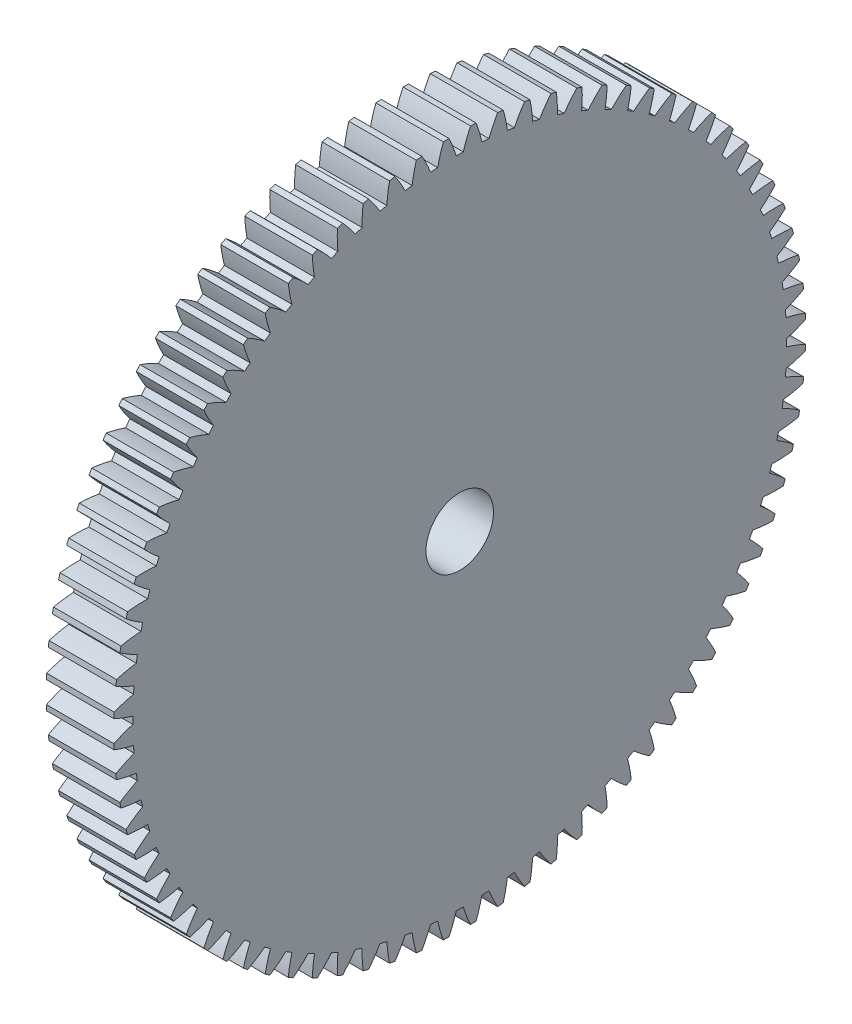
from build123d import *

# Parameters (mm, degrees)
BASPROSKE_W     = 4
BASPROSKE_H     = 20.5
TOOTHCUT_DEPTH  = 30.266021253
TEETHCUTS_COUNT = 80
TEETHCUTS_ANGLE = 355.5
BORSKE_R        = 2
BORE_DEPTH      = 50.0000508


with BuildPart() as part:
    # BasProSke → Base-Revolve (revolve)
    with BuildSketch(Plane(origin=(0, 0, 0), x_dir=(1, 0, 0), z_dir=(0, 1, 0)), mode=Mode.PRIVATE) as base_revolve_sk:
        with Locations((2, 10.25)):
            Rectangle(BASPROSKE_W, BASPROSKE_H)
    revolve(base_revolve_sk.sketch.rotate(Axis((-10, 0, 0), (1, 0, 0)), 180), axis=Axis((-10, 0, 0), (1, 0, 0)))

    # TooCutSke → ToothCut (cut, through all)
    with BuildSketch(Plane(origin=(0, 0, 0), x_dir=(0, 0, -1), z_dir=(1, 0, 0))):
        with BuildLine():
            ThreePointArc((0.210127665, 19.372860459), (0, 19.374), (-0.210127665, 19.372860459))
            ThreePointArc((-0.210127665, 19.372860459), (-0.409130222, 19.952418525), (-0.651908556, 20.515044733))
            ThreePointArc((-0.651908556, 20.515044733), (0, 20.5254), (0.651908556, 20.515044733))
            ThreePointArc((0.651908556, 20.515044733), (0.409130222, 19.952418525), (0.210127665, 19.372860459))
        make_face()
    toothcut = extrude(amount=TOOTHCUT_DEPTH, mode=Mode.SUBTRACT)

    # TeethCuts: ToothCut ×80 about axis
    teethcuts_axis = Axis((-10, 0, 0), (1, 0, 0))
    for i in range(1, TEETHCUTS_COUNT):
        add(toothcut.rotate(teethcuts_axis, i * TEETHCUTS_ANGLE / (TEETHCUTS_COUNT - 1)), mode=Mode.SUBTRACT)

    # BorSke → Bore (cut, symmetric)
    with BuildSketch(Plane(origin=(0, 0, 0), x_dir=(0, 0, -1), z_dir=(1, 0, 0))):
        with Locations(Location((0, 0, 0), (0, 0, 180))):
            Circle(BORSKE_R)
    extrude(amount=BORE_DEPTH, both=True, mode=Mode.SUBTRACT)


solid = part.part
